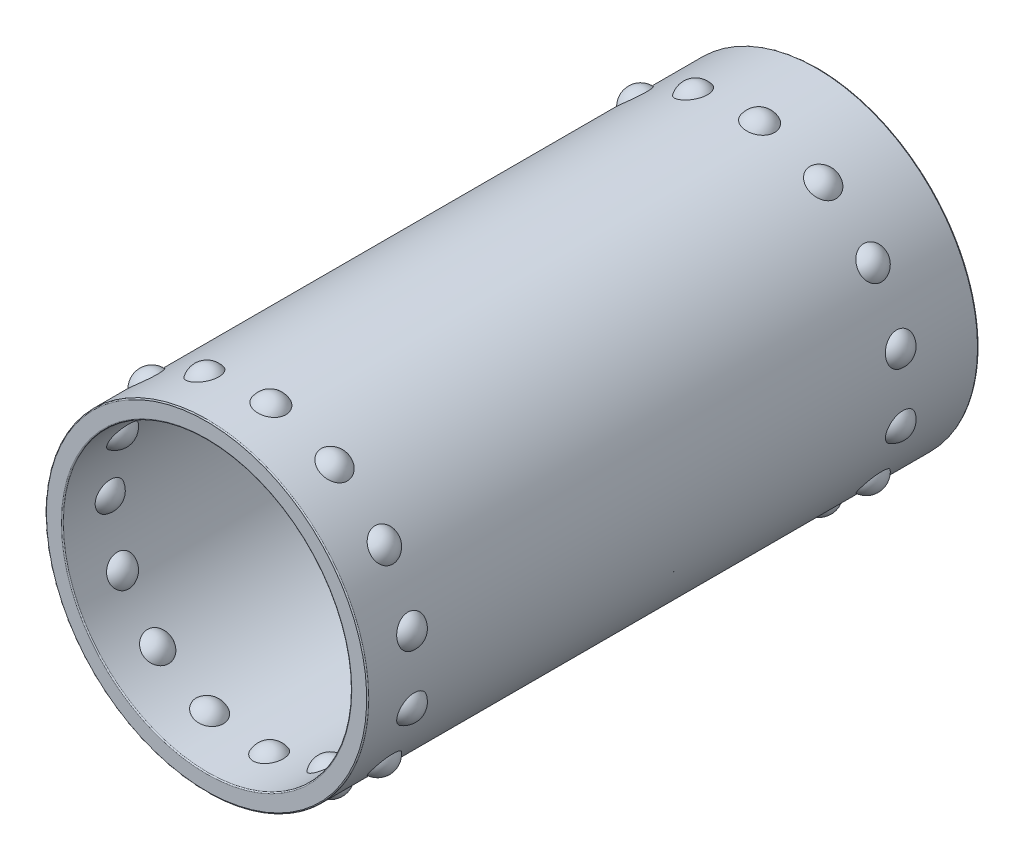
from build123d import *

# Parameters (mm, degrees)
CIRPATTERN6_COUNT = 15
LPATTERN2_COUNT   = 2
LPATTERN2_PITCH   = 91.44


with BuildPart() as part:
    # Logo3_bib1 → Revolve1 (revolve)
    with BuildSketch(Plane(origin=(0, 0, 0), x_dir=(-1, 0, 0), z_dir=(0, -1, 0))):
        with BuildLine():
            Line((26.9875, 6.15), (26.9875, -107.75))
            ThreePointArc((26.9875, -107.75), (27.046078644, -107.891421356), (27.1875, -107.95))
            Line((27.1875, -107.95), (29.9625, -107.95))
            ThreePointArc((29.9625, -107.95), (30.103921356, -107.891421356), (30.1625, -107.75))
            Line((30.1625, -107.75), (30.1625, 6.15))
            ThreePointArc((30.1625, 6.15), (30.103921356, 6.291421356), (29.9625, 6.35))
            Line((29.9625, 6.35), (27.1875, 6.35))
            ThreePointArc((27.1875, 6.35), (27.046078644, 6.291421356), (26.9875, 6.15))
        make_face()
    revolve(axis=Axis((0, 0, -41.537203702), (0, 0, 1)))

    # Sketch3 → Revolve6 (revolve)
    with BuildSketch(Plane.XY.offset(7.62)):
        with BuildLine():
            Line((-25.4, 0), (-31.75, 0))
            ThreePointArc((-31.75, 0), (-28.575, 3.175), (-25.4, 0))
        make_face()
    revolve6 = revolve(axis=Axis((0, 0, 7.62), (-1, 0, 0)))

    # CirPattern6: Revolve6 ×15 about axis
    cirpattern6_axis = Axis((0, 0, 0), (0, 0, 1))
    for i in range(1, CIRPATTERN6_COUNT):
        add(revolve6.rotate(cirpattern6_axis, i * 360 / CIRPATTERN6_COUNT))

    # LPattern2: Revolve6 ×2
    with Locations(*[(0, 0, i * LPATTERN2_PITCH) for i in range(1, LPATTERN2_COUNT)]):
        add(revolve6)

    # LPattern2 copy 1 sketch → LPattern2 copy 1 (revolve)
    with BuildSketch(Plane(origin=(0, 0, 99.06), x_dir=(0.9135454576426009, 0.4067366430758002, 0), z_dir=(0, 0, 1))):
        with BuildLine():
            Line((-25.4, 0), (-31.75, 0))
            ThreePointArc((-31.75, 0), (-28.575, 3.175), (-25.4, 0))
        make_face()
    revolve(axis=Axis((0, 0, 99.06), (-0.9135454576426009, -0.4067366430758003, 0)))

    # LPattern2 copy 2 sketch → LPattern2 copy 2 (revolve)
    with BuildSketch(Plane(origin=(0, 0, 99.06), x_dir=(0.6691306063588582, 0.7431448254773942, 0), z_dir=(0, 0, 1))):
        with BuildLine():
            Line((-25.4, 0), (-31.75, 0))
            ThreePointArc((-31.75, 0), (-28.575, 3.175), (-25.4, 0))
        make_face()
    revolve(axis=Axis((0, 0, 99.06), (-0.6691306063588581, -0.7431448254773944, 0)))

    # LPattern2 copy 3 sketch → LPattern2 copy 3 (revolve)
    with BuildSketch(Plane(origin=(0, 0, 99.06), x_dir=(0.30901699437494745, 0.9510565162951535, 0), z_dir=(0, 0, 1))):
        with BuildLine():
            Line((-25.4, 0), (-31.75, 0))
            ThreePointArc((-31.75, 0), (-28.575, 3.175), (-25.4, 0))
        make_face()
    revolve(axis=Axis((0, 0, 99.06), (-0.30901699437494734, -0.9510565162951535, 0)))

    # LPattern2 copy 4 sketch → LPattern2 copy 4 (revolve)
    with BuildSketch(Plane(origin=(0, 0, 99.06), x_dir=(-0.10452846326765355, 0.9945218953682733, 0), z_dir=(0, 0, 1))):
        with BuildLine():
            Line((-25.4, 0), (-31.75, 0))
            ThreePointArc((-31.75, 0), (-28.575, 3.175), (-25.4, 0))
        make_face()
    revolve(axis=Axis((0, 0, 99.06), (0.10452846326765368, -0.9945218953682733, 0)))

    # LPattern2 copy 5 sketch → LPattern2 copy 5 (revolve)
    with BuildSketch(Plane(origin=(0, 0, 99.06), x_dir=(-0.4999999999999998, 0.8660254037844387, 0), z_dir=(0, 0, 1))):
        with BuildLine():
            Line((-25.4, 0), (-31.75, 0))
            ThreePointArc((-31.75, 0), (-28.575, 3.175), (-25.4, 0))
        make_face()
    revolve(axis=Axis((0, 0, 99.06), (0.4999999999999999, -0.8660254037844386, 0)))

    # LPattern2 copy 6 sketch → LPattern2 copy 6 (revolve)
    with BuildSketch(Plane(origin=(0, 0, 99.06), x_dir=(-0.8090169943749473, 0.5877852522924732, 0), z_dir=(0, 0, 1))):
        with BuildLine():
            Line((-25.4, 0), (-31.75, 0))
            ThreePointArc((-31.75, 0), (-28.575, 3.175), (-25.4, 0))
        make_face()
    revolve(axis=Axis((0, 0, 99.06), (0.8090169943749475, -0.5877852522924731, 0)))

    # LPattern2 copy 7 sketch → LPattern2 copy 7 (revolve)
    with BuildSketch(Plane(origin=(0, 0, 99.06), x_dir=(-0.9781476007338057, 0.20791169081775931, 0), z_dir=(0, 0, 1))):
        with BuildLine():
            Line((-25.4, 0), (-31.75, 0))
            ThreePointArc((-31.75, 0), (-28.575, 3.175), (-25.4, 0))
        make_face()
    revolve(axis=Axis((0, 0, 99.06), (0.9781476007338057, -0.2079116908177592, 0)))

    # LPattern2 copy 8 sketch → LPattern2 copy 8 (revolve)
    with BuildSketch(Plane(origin=(0, 0, 99.06), x_dir=(-0.9781476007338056, -0.2079116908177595, 0), z_dir=(0, 0, 1))):
        with BuildLine():
            Line((-25.4, 0), (-31.75, 0))
            ThreePointArc((-31.75, 0), (-28.575, 3.175), (-25.4, 0))
        make_face()
    revolve(axis=Axis((0, 0, 99.06), (0.9781476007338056, 0.20791169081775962, 0)))

    # LPattern2 copy 9 sketch → LPattern2 copy 9 (revolve)
    with BuildSketch(Plane(origin=(0, 0, 99.06), x_dir=(-0.8090169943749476, -0.587785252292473, 0), z_dir=(0, 0, 1))):
        with BuildLine():
            Line((-25.4, 0), (-31.75, 0))
            ThreePointArc((-31.75, 0), (-28.575, 3.175), (-25.4, 0))
        make_face()
    revolve(axis=Axis((0, 0, 99.06), (0.8090169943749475, 0.5877852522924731, 0)))

    # LPattern2 copy 10 sketch → LPattern2 copy 10 (revolve)
    with BuildSketch(Plane(origin=(0, 0, 99.06), x_dir=(-0.5000000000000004, -0.8660254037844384, 0), z_dir=(0, 0, 1))):
        with BuildLine():
            Line((-25.4, 0), (-31.75, 0))
            ThreePointArc((-31.75, 0), (-28.575, 3.175), (-25.4, 0))
        make_face()
    revolve(axis=Axis((0, 0, 99.06), (0.5000000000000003, 0.8660254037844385, 0)))

    # LPattern2 copy 11 sketch → LPattern2 copy 11 (revolve)
    with BuildSketch(Plane(origin=(0, 0, 99.06), x_dir=(-0.10452846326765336, -0.9945218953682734, 0), z_dir=(0, 0, 1))):
        with BuildLine():
            Line((-25.4, 0), (-31.75, 0))
            ThreePointArc((-31.75, 0), (-28.575, 3.175), (-25.4, 0))
        make_face()
    revolve(axis=Axis((0, 0, 99.06), (0.10452846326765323, 0.9945218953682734, 0)))

    # LPattern2 copy 12 sketch → LPattern2 copy 12 (revolve)
    with BuildSketch(Plane(origin=(0, 0, 99.06), x_dir=(0.30901699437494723, -0.9510565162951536, 0), z_dir=(0, 0, 1))):
        with BuildLine():
            Line((-25.4, 0), (-31.75, 0))
            ThreePointArc((-31.75, 0), (-28.575, 3.175), (-25.4, 0))
        make_face()
    revolve(axis=Axis((0, 0, 99.06), (-0.30901699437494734, 0.9510565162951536, 0)))

    # LPattern2 copy 13 sketch → LPattern2 copy 13 (revolve)
    with BuildSketch(Plane(origin=(0, 0, 99.06), x_dir=(0.6691306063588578, -0.7431448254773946, 0), z_dir=(0, 0, 1))):
        with BuildLine():
            Line((-25.4, 0), (-31.75, 0))
            ThreePointArc((-31.75, 0), (-28.575, 3.175), (-25.4, 0))
        make_face()
    revolve(axis=Axis((0, 0, 99.06), (-0.6691306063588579, 0.7431448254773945, 0)))

    # LPattern2 copy 14 sketch → LPattern2 copy 14 (revolve)
    with BuildSketch(Plane(origin=(0, 0, 99.06), x_dir=(0.913545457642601, -0.40673664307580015, 0), z_dir=(0, 0, 1))):
        with BuildLine():
            Line((-25.4, 0), (-31.75, 0))
            ThreePointArc((-31.75, 0), (-28.575, 3.175), (-25.4, 0))
        make_face()
    revolve(axis=Axis((0, 0, 99.06), (-0.913545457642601, 0.40673664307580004, 0)))


solid = part.part
